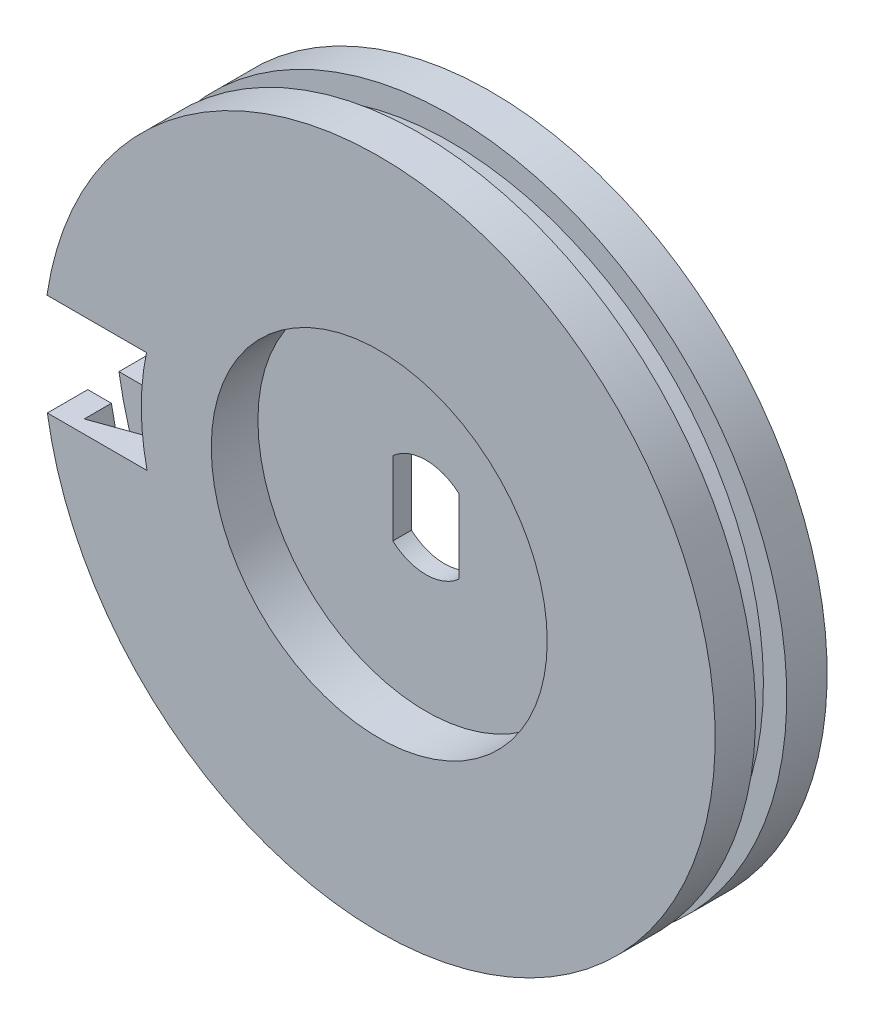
from build123d import *

# Parameters (mm, degrees)
SKETCH1_W             = 38.1
SKETCH1_H             = 57.15
SKETCH1_W_2           = 6.35
SKETCH1_H_2           = 34.925
SKETCH1_W_3           = 50.8
SKETCH1_H_3           = 9.525
FILLET1_R             = 6.35
SKETCH3_W             = 6.35
SKETCH3_H             = 15.24
CUT_EXTRUDE1_DEPTH    = 170.439133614
SKETCH5_R             = 41.081009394
CUT_EXTRUDE2_DEPTH    = 27.94
SKETCH6_R             = 43.29759406
CUT_EXTRUDE3_DEPTH    = 27.94
BOSS_EXTRUDE1_START   = -6.35
BOSS_EXTRUDE1_DEPTH   = 6.35
SCALE1_SCALE          = 0.16
M2X0_4_TAPPED_HOLE1_D = 1.6
SKETCH30_R            = 18.288
SKETCH30_R_2          = 17.018
BOSS_EXTRUDE6_DEPTH   = 2.2
BOSS_EXTRUDE7_START   = -2.2
SKETCH31_R            = 18.288
SKETCH31_R_2          = 17.018
BOSS_EXTRUDE7_DEPTH   = 2.2
CUT_EXTRUDE6_DEPTH    = 27.57184796
SKETCH27_R            = 2
CUT_EXTRUDE7_DEPTH    = 4
CUT_EXTRUDE8_DEPTH    = 2.54


with BuildPart() as part:
    # Sketch1 → Revolve1 (revolve)
    with BuildSketch(Plane(origin=(0, 0, 0), x_dir=(0, 0, -1), z_dir=(1, 0, 0)), mode=Mode.PRIVATE) as revolve1_sk:
        with Locations((0, 85.725)):
            Rectangle(SKETCH1_W, SKETCH1_H)
        with Locations((0, 39.6875)):
            Rectangle(SKETCH1_W_2, SKETCH1_H_2)
        with Locations((0, 17.4625)):
            Rectangle(SKETCH1_W_3, SKETCH1_H_3)
    revolve(revolve1_sk.sketch.rotate(Axis((0, 0, 0), (0, 0, -1)), 90), axis=Axis((0, 0, 0), (0, 0, -1)))

    # Sketch2 → Cut-Revolve1 (revolve, cut)
    with BuildSketch(Plane(origin=(0, 0, 0), x_dir=(0, 0, -1), z_dir=(1, 0, 0)), mode=Mode.PRIVATE) as cut_revolve1_sk:
        Polygon((17.44381274, 114.3), (6.35, 83.82), (-6.35, 83.82), (-17.44381274, 114.3), align=None)
    revolve(cut_revolve1_sk.sketch.rotate(Axis((0, 0, 0), (0, 0, 1)), 90), axis=Axis((0, 0, 0), (0, 0, 1)), mode=Mode.SUBTRACT)

    # Fillet1
    fillet1_edges = [part.edges().sort_by_distance(p)[0] for p in [
        (-57.15, 0, -3.175),
        (-22.225, 0, -3.175),
    ]]
    fillet(fillet1_edges, radius=FILLET1_R)

    # Sketch3 → Cut-Extrude1 (cut, through all)
    with BuildSketch(Plane(origin=(0, 0, -25.4), x_dir=(-1, 0, 0), z_dir=(0, 0, -1))):
        with Locations((0, 7.62)):
            Rectangle(SKETCH3_W, SKETCH3_H)
    extrude(amount=-CUT_EXTRUDE1_DEPTH, mode=Mode.SUBTRACT)

    # Sketch5 → Cut-Extrude2 (cut)
    with BuildSketch(Plane.XY.offset(3.175)):
        Circle(SKETCH5_R)
    extrude(amount=CUT_EXTRUDE2_DEPTH, mode=Mode.SUBTRACT)

    # Sketch6 → Cut-Extrude3 (cut)
    with BuildSketch(Plane(origin=(0, 0, -3.175), x_dir=(-1, 0, 0), z_dir=(0, 0, -1))):
        Circle(SKETCH6_R)
    extrude(amount=CUT_EXTRUDE3_DEPTH, mode=Mode.SUBTRACT)

    # Sketch7 → Boss-Extrude1 (add)
    with BuildSketch(Plane(origin=(0, 0, -3.175), x_dir=(-1, 0, 0), z_dir=(0, 0, -1)).offset(BOSS_EXTRUDE1_START)):
        with BuildLine():
            Line((-3.175, 12.296722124), (-3.175, 15.24))
            Line((-3.175, 15.24), (3.175, 15.24))
            Line((3.175, 15.24), (3.175, 12.296722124))
            ThreePointArc((3.175, 12.296722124), (0, -12.7), (-3.175, 12.296722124))
        make_face()
    extrude(amount=BOSS_EXTRUDE1_DEPTH)


with BuildPart() as part_1:
    # Scale1: scaled about (0, 0, -0.017929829)
    add(part.part.scale(SCALE1_SCALE).moved(Location((0, 0, -0.015061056))))

    # M2x0.4 Tapped Hole1 (through all)
    with Locations(Plane.XY.offset(0.492938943)):
        with Locations((0, 0)):
            Hole(M2X0_4_TAPPED_HOLE1_D / 2)

    # Sketch30 → Boss-Extrude6 (add)
    with BuildSketch(Plane(origin=(0, 0, -3.063061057), x_dir=(-1, 0, 0), z_dir=(0, 0, -1))):
        with Locations(Location((0, 0, 0), (0, 0, 180))):
            Circle(SKETCH30_R)
        Circle(SKETCH30_R_2, mode=Mode.SUBTRACT)
    extrude(amount=-BOSS_EXTRUDE6_DEPTH)

    # Sketch31 → Boss-Extrude7 (add)
    with BuildSketch(Plane.XY.offset(3.032938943).offset(BOSS_EXTRUDE7_START)):
        Circle(SKETCH31_R)
        with Locations(Location((0, 0, 0), (0, 0, 180))):
            Circle(SKETCH31_R_2, mode=Mode.SUBTRACT)
    extrude(amount=BOSS_EXTRUDE7_DEPTH)

    # Sketch32 → Cut-Extrude6 (cut, through all)
    with BuildSketch(Plane.XY.offset(3.032938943)):
        with BuildLine():
            Line((-12.638648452, -2.840894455), (-23.582581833, -2.840894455))
            Line((-23.582581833, -2.840894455), (-23.582581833, 2.700330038))
            Line((-23.582581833, 2.700330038), (-12.669425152, 2.700330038))
            ThreePointArc((-12.669425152, 2.700330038), (-12.9538002, -0.071947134), (-12.638648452, -2.840894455))
        make_face()
    extrude(amount=-CUT_EXTRUDE6_DEPTH, mode=Mode.SUBTRACT)

    # Sketch27 → Cut-Extrude7 (cut)
    with BuildSketch(Plane.ZY.offset(13.4112)):
        with Locations(Location((0.111938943, 0, 0), (0, 0, 270))):
            Circle(SKETCH27_R)
    extrude(amount=-CUT_EXTRUDE7_DEPTH, mode=Mode.SUBTRACT)

    # Sketch34 → Cut-Extrude8 (cut)
    with BuildSketch(Plane.XY.offset(0.492938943)):
        with BuildLine():
            Line((-1.8, -2.01246118), (-1.8, 2.01246118))
            ThreePointArc((-1.8, 2.01246118), (0, 2.7), (1.8, 2.01246118))
            Line((1.8, 2.01246118), (1.8, -2.01246118))
            ThreePointArc((1.8, -2.01246118), (0, -2.7), (-1.8, -2.01246118))
        make_face()
    extrude(amount=-CUT_EXTRUDE8_DEPTH, mode=Mode.SUBTRACT)


solid = part_1.part
